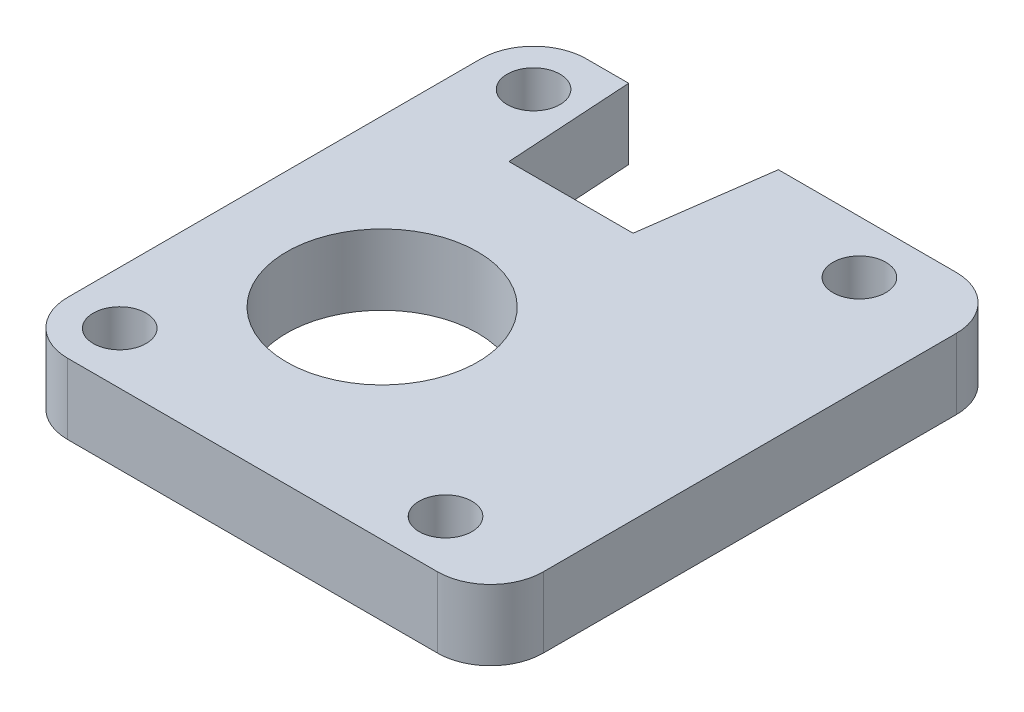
ISO-10303-21;
HEADER;
FILE_DESCRIPTION(('STEP AP214'),'2;1');
FILE_NAME('part.step','',(''),(''),'','','');
FILE_SCHEMA(('AUTOMOTIVE_DESIGN { 1 0 10303 214 1 1 1 1 }'));
ENDSEC;
DATA;
#1=APPLICATION_CONTEXT('core data for automotive mechanical design processes');
#2=APPLICATION_PROTOCOL_DEFINITION('international standard','automotive_design',2000,#1);
#3=PRODUCT_CONTEXT('',#1,'mechanical');
#4=PRODUCT('Part','Part','',(#3));
#5=PRODUCT_RELATED_PRODUCT_CATEGORY('part','',(#4));
#6=PRODUCT_DEFINITION_FORMATION('','',#4);
#7=PRODUCT_DEFINITION_CONTEXT('part definition',#1,'design');
#8=PRODUCT_DEFINITION('design','',#6,#7);
#9=PRODUCT_DEFINITION_SHAPE('','',#8);
#10=(LENGTH_UNIT() NAMED_UNIT(*) SI_UNIT(.MILLI.,.METRE.));
#11=(NAMED_UNIT(*) PLANE_ANGLE_UNIT() SI_UNIT($,.RADIAN.));
#12=(NAMED_UNIT(*) SI_UNIT($,.STERADIAN.) SOLID_ANGLE_UNIT());
#13=UNCERTAINTY_MEASURE_WITH_UNIT(LENGTH_MEASURE(1.E-05),#10,'distance_accuracy_value','');
#14=(GEOMETRIC_REPRESENTATION_CONTEXT(3) GLOBAL_UNCERTAINTY_ASSIGNED_CONTEXT((#13)) GLOBAL_UNIT_ASSIGNED_CONTEXT((#10,
#11,#12)) REPRESENTATION_CONTEXT('',''));
#15=CARTESIAN_POINT('',(0.,0.,0.));
#16=DIRECTION('',(0.,0.,1.));
#17=DIRECTION('',(1.,0.,0.));
#18=AXIS2_PLACEMENT_3D('',#15,#16,#17);
#19=CARTESIAN_POINT('',(0.,2.,0.));
#20=DIRECTION('',(0.,1.,0.));
#21=DIRECTION('',(0.,0.,1.));
#22=AXIS2_PLACEMENT_3D('',#19,#20,#21);
#23=PLANE('',#22);
#24=CARTESIAN_POINT('',(-4.1,2.,3.275));
#25=DIRECTION('',(0.,1.,0.));
#26=DIRECTION('',(0.,0.,1.));
#27=AXIS2_PLACEMENT_3D('',#24,#25,#26);
#28=CIRCLE('',#27,5.425);
#29=CARTESIAN_POINT('',(-4.1,2.,8.7));
#30=VERTEX_POINT('',#29);
#31=EDGE_CURVE('E187',#30,#30,#28,.F.);
#32=ORIENTED_EDGE('',*,*,#31,.T.);
#33=EDGE_LOOP('',(#32));
#34=FACE_BOUND('',#33,.T.);
#35=CARTESIAN_POINT('',(-10.5,2.,-11.725));
#36=DIRECTION('',(0.,1.,0.));
#37=DIRECTION('',(0.,0.,1.));
#38=AXIS2_PLACEMENT_3D('',#35,#36,#37);
#39=CIRCLE('',#38,1.5);
#40=CARTESIAN_POINT('',(-10.5,2.,-10.225));
#41=VERTEX_POINT('',#40);
#42=EDGE_CURVE('E190',#41,#41,#39,.F.);
#43=ORIENTED_EDGE('',*,*,#42,.T.);
#44=EDGE_LOOP('',(#43));
#45=FACE_BOUND('',#44,.T.);
#46=CARTESIAN_POINT('',(-10.5,2.,11.775));
#47=DIRECTION('',(0.,1.,0.));
#48=DIRECTION('',(0.,0.,1.));
#49=AXIS2_PLACEMENT_3D('',#46,#47,#48);
#50=CIRCLE('',#49,1.5);
#51=CARTESIAN_POINT('',(-10.5,2.,13.275));
#52=VERTEX_POINT('',#51);
#53=EDGE_CURVE('E193',#52,#52,#50,.F.);
#54=ORIENTED_EDGE('',*,*,#53,.T.);
#55=EDGE_LOOP('',(#54));
#56=FACE_BOUND('',#55,.T.);
#57=CARTESIAN_POINT('',(8.,2.,11.775));
#58=DIRECTION('',(0.,1.,0.));
#59=DIRECTION('',(0.,0.,1.));
#60=AXIS2_PLACEMENT_3D('',#57,#58,#59);
#61=CIRCLE('',#60,1.5);
#62=CARTESIAN_POINT('',(8.,2.,13.275));
#63=VERTEX_POINT('',#62);
#64=EDGE_CURVE('E196',#63,#63,#61,.F.);
#65=ORIENTED_EDGE('',*,*,#64,.T.);
#66=EDGE_LOOP('',(#65));
#67=FACE_BOUND('',#66,.T.);
#68=CARTESIAN_POINT('',(8.,2.,-11.725));
#69=DIRECTION('',(0.,1.,0.));
#70=DIRECTION('',(0.,0.,1.));
#71=AXIS2_PLACEMENT_3D('',#68,#69,#70);
#72=CIRCLE('',#71,1.5);
#73=CARTESIAN_POINT('',(8.,2.,-10.225));
#74=VERTEX_POINT('',#73);
#75=EDGE_CURVE('E199',#74,#74,#72,.F.);
#76=ORIENTED_EDGE('',*,*,#75,.T.);
#77=EDGE_LOOP('',(#76));
#78=FACE_BOUND('',#77,.T.);
#79=DIRECTION('',(-1.,0.,0.));
#80=VECTOR('',#79,1.);
#81=CARTESIAN_POINT('',(-8.1,2.,-14.725));
#82=LINE('',#81,#80);
#83=CARTESIAN_POINT('',(-10.5,2.,-14.725));
#84=VERTEX_POINT('',#83);
#85=CARTESIAN_POINT('',(-8.1,2.,-14.725));
#86=VERTEX_POINT('',#85);
#87=EDGE_CURVE('E117',#84,#86,#82,.F.);
#88=ORIENTED_EDGE('',*,*,#87,.F.);
#89=CARTESIAN_POINT('',(-10.5,2.,-11.725));
#90=DIRECTION('',(0.,1.,0.));
#91=DIRECTION('',(0.,0.,1.));
#92=AXIS2_PLACEMENT_3D('',#89,#90,#91);
#93=CIRCLE('',#92,3.);
#94=CARTESIAN_POINT('',(-13.5,2.,-11.725));
#95=VERTEX_POINT('',#94);
#96=EDGE_CURVE('E20',#95,#84,#93,.F.);
#97=ORIENTED_EDGE('',*,*,#96,.F.);
#98=DIRECTION('',(0.,0.,1.));
#99=VECTOR('',#98,1.);
#100=CARTESIAN_POINT('',(-13.5,2.,-11.725));
#101=LINE('',#100,#99);
#102=CARTESIAN_POINT('',(-13.5,2.,11.725));
#103=VERTEX_POINT('',#102);
#104=EDGE_CURVE('E103',#103,#95,#101,.F.);
#105=ORIENTED_EDGE('',*,*,#104,.F.);
#106=CARTESIAN_POINT('',(-10.5,2.,11.725));
#107=DIRECTION('',(0.,1.,0.));
#108=DIRECTION('',(0.,0.,1.));
#109=AXIS2_PLACEMENT_3D('',#106,#107,#108);
#110=CIRCLE('',#109,3.);
#111=CARTESIAN_POINT('',(-10.5,2.,14.725));
#112=VERTEX_POINT('',#111);
#113=EDGE_CURVE('E124',#112,#103,#110,.F.);
#114=ORIENTED_EDGE('',*,*,#113,.F.);
#115=DIRECTION('',(1.,0.,0.));
#116=VECTOR('',#115,1.);
#117=CARTESIAN_POINT('',(-10.5,2.,14.725));
#118=LINE('',#117,#116);
#119=CARTESIAN_POINT('',(10.5,2.,14.725));
#120=VERTEX_POINT('',#119);
#121=EDGE_CURVE('E158',#120,#112,#118,.F.);
#122=ORIENTED_EDGE('',*,*,#121,.F.);
#123=CARTESIAN_POINT('',(10.5,2.,11.725));
#124=DIRECTION('',(0.,1.,0.));
#125=DIRECTION('',(0.,0.,1.));
#126=AXIS2_PLACEMENT_3D('',#123,#124,#125);
#127=CIRCLE('',#126,3.);
#128=CARTESIAN_POINT('',(13.5,2.,11.725));
#129=VERTEX_POINT('',#128);
#130=EDGE_CURVE('E204',#129,#120,#127,.F.);
#131=ORIENTED_EDGE('',*,*,#130,.F.);
#132=DIRECTION('',(0.,0.,-1.));
#133=VECTOR('',#132,1.);
#134=CARTESIAN_POINT('',(13.5,2.,11.725));
#135=LINE('',#134,#133);
#136=CARTESIAN_POINT('',(13.5,2.,-11.725));
#137=VERTEX_POINT('',#136);
#138=EDGE_CURVE('E154',#137,#129,#135,.F.);
#139=ORIENTED_EDGE('',*,*,#138,.F.);
#140=CARTESIAN_POINT('',(10.5,2.,-11.725));
#141=DIRECTION('',(0.,1.,0.));
#142=DIRECTION('',(0.,0.,1.));
#143=AXIS2_PLACEMENT_3D('',#140,#141,#142);
#144=CIRCLE('',#143,3.);
#145=CARTESIAN_POINT('',(10.5,2.,-14.725));
#146=VERTEX_POINT('',#145);
#147=EDGE_CURVE('E202',#146,#137,#144,.F.);
#148=ORIENTED_EDGE('',*,*,#147,.F.);
#149=DIRECTION('',(-1.,0.,0.));
#150=VECTOR('',#149,1.);
#151=CARTESIAN_POINT('',(10.5,2.,-14.725));
#152=LINE('',#151,#150);
#153=CARTESIAN_POINT('',(0.4,2.,-14.725));
#154=VERTEX_POINT('',#153);
#155=EDGE_CURVE('E149',#154,#146,#152,.F.);
#156=ORIENTED_EDGE('',*,*,#155,.F.);
#157=DIRECTION('',(-0.136637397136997,0.,0.99062112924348));
#158=VECTOR('',#157,1.);
#159=CARTESIAN_POINT('',(0.4,2.,-14.725));
#160=LINE('',#159,#158);
#161=CARTESIAN_POINT('',(-0.599999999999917,2.,-7.47499999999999));
#162=VERTEX_POINT('',#161);
#163=EDGE_CURVE('E144',#162,#154,#160,.F.);
#164=ORIENTED_EDGE('',*,*,#163,.F.);
#165=DIRECTION('',(-1.,0.,0.));
#166=VECTOR('',#165,1.);
#167=CARTESIAN_POINT('',(-0.6,2.,-7.475));
#168=LINE('',#167,#166);
#169=CARTESIAN_POINT('',(-7.65,2.,-7.475));
#170=VERTEX_POINT('',#169);
#171=EDGE_CURVE('E139',#170,#162,#168,.F.);
#172=ORIENTED_EDGE('',*,*,#171,.F.);
#173=DIRECTION('',(-0.0619497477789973,0.,-0.998079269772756));
#174=VECTOR('',#173,1.);
#175=CARTESIAN_POINT('',(-7.65,2.,-7.475));
#176=LINE('',#175,#174);
#177=EDGE_CURVE('E129',#86,#170,#176,.F.);
#178=ORIENTED_EDGE('',*,*,#177,.F.);
#179=EDGE_LOOP('',(#88,#97,#105,#114,#122,#131,#139,#148,#156,#164,#172,#178));
#180=FACE_BOUND('',#179,.T.);
#181=ADVANCED_FACE('F17',(#34,#45,#56,#67,#78,#180),#23,.T.);
#182=CARTESIAN_POINT('',(-10.5,-2.,-11.725));
#183=DIRECTION('',(0.,1.,0.));
#184=DIRECTION('',(0.,0.,1.));
#185=AXIS2_PLACEMENT_3D('',#182,#183,#184);
#186=CYLINDRICAL_SURFACE('',#185,3.);
#187=DIRECTION('',(0.,1.,0.));
#188=VECTOR('',#187,1.);
#189=CARTESIAN_POINT('',(-10.5,-2.,-14.725));
#190=LINE('',#189,#188);
#191=CARTESIAN_POINT('',(-10.5,-2.,-14.725));
#192=VERTEX_POINT('',#191);
#193=EDGE_CURVE('E136',#192,#84,#190,.T.);
#194=ORIENTED_EDGE('',*,*,#193,.F.);
#195=CARTESIAN_POINT('',(-10.5,-2.,-11.725));
#196=DIRECTION('',(0.,1.,0.));
#197=DIRECTION('',(0.,0.,1.));
#198=AXIS2_PLACEMENT_3D('',#195,#196,#197);
#199=CIRCLE('',#198,3.);
#200=CARTESIAN_POINT('',(-13.5,-2.,-11.725));
#201=VERTEX_POINT('',#200);
#202=EDGE_CURVE('E123',#192,#201,#199,.T.);
#203=ORIENTED_EDGE('',*,*,#202,.T.);
#204=DIRECTION('',(0.,1.,0.));
#205=VECTOR('',#204,1.);
#206=CARTESIAN_POINT('',(-13.5,-2.,-11.725));
#207=LINE('',#206,#205);
#208=EDGE_CURVE('E108',#95,#201,#207,.F.);
#209=ORIENTED_EDGE('',*,*,#208,.F.);
#210=ORIENTED_EDGE('',*,*,#96,.T.);
#211=EDGE_LOOP('',(#194,#203,#209,#210));
#212=FACE_BOUND('',#211,.T.);
#213=ADVANCED_FACE('F122',(#212),#186,.T.);
#214=CARTESIAN_POINT('',(-13.5,-2.,-11.725));
#215=DIRECTION('',(-1.,0.,0.));
#216=DIRECTION('',(0.,0.,1.));
#217=AXIS2_PLACEMENT_3D('',#214,#215,#216);
#218=PLANE('',#217);
#219=ORIENTED_EDGE('',*,*,#208,.T.);
#220=DIRECTION('',(0.,0.,1.));
#221=VECTOR('',#220,1.);
#222=CARTESIAN_POINT('',(-13.5,-2.,0.));
#223=LINE('',#222,#221);
#224=CARTESIAN_POINT('',(-13.5,-2.,11.725));
#225=VERTEX_POINT('',#224);
#226=EDGE_CURVE('E185',#201,#225,#223,.T.);
#227=ORIENTED_EDGE('',*,*,#226,.T.);
#228=DIRECTION('',(0.,1.,0.));
#229=VECTOR('',#228,1.);
#230=CARTESIAN_POINT('',(-13.5,-2.,11.725));
#231=LINE('',#230,#229);
#232=EDGE_CURVE('E110',#103,#225,#231,.F.);
#233=ORIENTED_EDGE('',*,*,#232,.F.);
#234=ORIENTED_EDGE('',*,*,#104,.T.);
#235=EDGE_LOOP('',(#219,#227,#233,#234));
#236=FACE_BOUND('',#235,.T.);
#237=ADVANCED_FACE('F105',(#236),#218,.T.);
#238=CARTESIAN_POINT('',(-10.5,-2.,11.725));
#239=DIRECTION('',(0.,1.,0.));
#240=DIRECTION('',(0.,0.,1.));
#241=AXIS2_PLACEMENT_3D('',#238,#239,#240);
#242=CYLINDRICAL_SURFACE('',#241,3.);
#243=ORIENTED_EDGE('',*,*,#232,.T.);
#244=CARTESIAN_POINT('',(-10.5,-2.,11.725));
#245=DIRECTION('',(0.,1.,0.));
#246=DIRECTION('',(0.,0.,1.));
#247=AXIS2_PLACEMENT_3D('',#244,#245,#246);
#248=CIRCLE('',#247,3.);
#249=CARTESIAN_POINT('',(-10.5,-2.,14.725));
#250=VERTEX_POINT('',#249);
#251=EDGE_CURVE('E182',#225,#250,#248,.T.);
#252=ORIENTED_EDGE('',*,*,#251,.T.);
#253=DIRECTION('',(0.,1.,0.));
#254=VECTOR('',#253,1.);
#255=CARTESIAN_POINT('',(-10.5,-2.,14.725));
#256=LINE('',#255,#254);
#257=EDGE_CURVE('E159',#112,#250,#256,.F.);
#258=ORIENTED_EDGE('',*,*,#257,.F.);
#259=ORIENTED_EDGE('',*,*,#113,.T.);
#260=EDGE_LOOP('',(#243,#252,#258,#259));
#261=FACE_BOUND('',#260,.T.);
#262=ADVANCED_FACE('F293',(#261),#242,.T.);
#263=CARTESIAN_POINT('',(-10.5,-2.,14.725));
#264=DIRECTION('',(0.,0.,1.));
#265=DIRECTION('',(1.,0.,0.));
#266=AXIS2_PLACEMENT_3D('',#263,#264,#265);
#267=PLANE('',#266);
#268=ORIENTED_EDGE('',*,*,#257,.T.);
#269=DIRECTION('',(1.,0.,0.));
#270=VECTOR('',#269,1.);
#271=CARTESIAN_POINT('',(0.,-2.,14.725));
#272=LINE('',#271,#270);
#273=CARTESIAN_POINT('',(10.5,-2.,14.725));
#274=VERTEX_POINT('',#273);
#275=EDGE_CURVE('E181',#250,#274,#272,.T.);
#276=ORIENTED_EDGE('',*,*,#275,.T.);
#277=DIRECTION('',(0.,1.,0.));
#278=VECTOR('',#277,1.);
#279=CARTESIAN_POINT('',(10.5,-2.,14.725));
#280=LINE('',#279,#278);
#281=EDGE_CURVE('E157',#120,#274,#280,.F.);
#282=ORIENTED_EDGE('',*,*,#281,.F.);
#283=ORIENTED_EDGE('',*,*,#121,.T.);
#284=EDGE_LOOP('',(#268,#276,#282,#283));
#285=FACE_BOUND('',#284,.T.);
#286=ADVANCED_FACE('F290',(#285),#267,.T.);
#287=CARTESIAN_POINT('',(10.5,-2.,11.725));
#288=DIRECTION('',(0.,1.,0.));
#289=DIRECTION('',(0.,0.,1.));
#290=AXIS2_PLACEMENT_3D('',#287,#288,#289);
#291=CYLINDRICAL_SURFACE('',#290,3.);
#292=ORIENTED_EDGE('',*,*,#281,.T.);
#293=CARTESIAN_POINT('',(10.5,-2.,11.725));
#294=DIRECTION('',(0.,1.,0.));
#295=DIRECTION('',(0.,0.,1.));
#296=AXIS2_PLACEMENT_3D('',#293,#294,#295);
#297=CIRCLE('',#296,3.);
#298=CARTESIAN_POINT('',(13.5,-2.,11.725));
#299=VERTEX_POINT('',#298);
#300=EDGE_CURVE('E178',#274,#299,#297,.T.);
#301=ORIENTED_EDGE('',*,*,#300,.T.);
#302=DIRECTION('',(0.,1.,0.));
#303=VECTOR('',#302,1.);
#304=CARTESIAN_POINT('',(13.5,-2.,11.725));
#305=LINE('',#304,#303);
#306=EDGE_CURVE('E156',#129,#299,#305,.F.);
#307=ORIENTED_EDGE('',*,*,#306,.F.);
#308=ORIENTED_EDGE('',*,*,#130,.T.);
#309=EDGE_LOOP('',(#292,#301,#307,#308));
#310=FACE_BOUND('',#309,.T.);
#311=ADVANCED_FACE('F288',(#310),#291,.T.);
#312=CARTESIAN_POINT('',(13.5,-2.,11.725));
#313=DIRECTION('',(1.,0.,0.));
#314=DIRECTION('',(0.,0.,-1.));
#315=AXIS2_PLACEMENT_3D('',#312,#313,#314);
#316=PLANE('',#315);
#317=ORIENTED_EDGE('',*,*,#306,.T.);
#318=DIRECTION('',(0.,0.,1.));
#319=VECTOR('',#318,1.);
#320=CARTESIAN_POINT('',(13.5,-2.,0.));
#321=LINE('',#320,#319);
#322=CARTESIAN_POINT('',(13.5,-2.,-11.725));
#323=VERTEX_POINT('',#322);
#324=EDGE_CURVE('E177',#299,#323,#321,.F.);
#325=ORIENTED_EDGE('',*,*,#324,.T.);
#326=DIRECTION('',(0.,1.,0.));
#327=VECTOR('',#326,1.);
#328=CARTESIAN_POINT('',(13.5,-2.,-11.725));
#329=LINE('',#328,#327);
#330=EDGE_CURVE('E151',#137,#323,#329,.F.);
#331=ORIENTED_EDGE('',*,*,#330,.F.);
#332=ORIENTED_EDGE('',*,*,#138,.T.);
#333=EDGE_LOOP('',(#317,#325,#331,#332));
#334=FACE_BOUND('',#333,.T.);
#335=ADVANCED_FACE('F286',(#334),#316,.T.);
#336=CARTESIAN_POINT('',(10.5,-2.,-11.725));
#337=DIRECTION('',(0.,1.,0.));
#338=DIRECTION('',(0.,0.,1.));
#339=AXIS2_PLACEMENT_3D('',#336,#337,#338);
#340=CYLINDRICAL_SURFACE('',#339,3.);
#341=ORIENTED_EDGE('',*,*,#330,.T.);
#342=CARTESIAN_POINT('',(10.5,-2.,-11.725));
#343=DIRECTION('',(0.,1.,0.));
#344=DIRECTION('',(0.,0.,1.));
#345=AXIS2_PLACEMENT_3D('',#342,#343,#344);
#346=CIRCLE('',#345,3.);
#347=CARTESIAN_POINT('',(10.5,-2.,-14.725));
#348=VERTEX_POINT('',#347);
#349=EDGE_CURVE('E173',#323,#348,#346,.T.);
#350=ORIENTED_EDGE('',*,*,#349,.T.);
#351=DIRECTION('',(0.,1.,0.));
#352=VECTOR('',#351,1.);
#353=CARTESIAN_POINT('',(10.5,-2.,-14.725));
#354=LINE('',#353,#352);
#355=EDGE_CURVE('E146',#146,#348,#354,.F.);
#356=ORIENTED_EDGE('',*,*,#355,.F.);
#357=ORIENTED_EDGE('',*,*,#147,.T.);
#358=EDGE_LOOP('',(#341,#350,#356,#357));
#359=FACE_BOUND('',#358,.T.);
#360=ADVANCED_FACE('F282',(#359),#340,.T.);
#361=CARTESIAN_POINT('',(10.5,-2.,-14.725));
#362=DIRECTION('',(0.,0.,-1.));
#363=DIRECTION('',(-1.,0.,0.));
#364=AXIS2_PLACEMENT_3D('',#361,#362,#363);
#365=PLANE('',#364);
#366=ORIENTED_EDGE('',*,*,#355,.T.);
#367=DIRECTION('',(1.,0.,0.));
#368=VECTOR('',#367,1.);
#369=CARTESIAN_POINT('',(0.,-2.,-14.725));
#370=LINE('',#369,#368);
#371=CARTESIAN_POINT('',(0.4,-2.,-14.725));
#372=VERTEX_POINT('',#371);
#373=EDGE_CURVE('E176',#348,#372,#370,.F.);
#374=ORIENTED_EDGE('',*,*,#373,.T.);
#375=DIRECTION('',(0.,1.,0.));
#376=VECTOR('',#375,1.);
#377=CARTESIAN_POINT('',(0.4,-2.,-14.725));
#378=LINE('',#377,#376);
#379=EDGE_CURVE('E141',#154,#372,#378,.F.);
#380=ORIENTED_EDGE('',*,*,#379,.F.);
#381=ORIENTED_EDGE('',*,*,#155,.T.);
#382=EDGE_LOOP('',(#366,#374,#380,#381));
#383=FACE_BOUND('',#382,.T.);
#384=ADVANCED_FACE('F276',(#383),#365,.T.);
#385=CARTESIAN_POINT('',(0.4,-2.,-14.725));
#386=DIRECTION('',(-0.99062112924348,0.,-0.136637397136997));
#387=DIRECTION('',(-0.136637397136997,0.,0.99062112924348));
#388=AXIS2_PLACEMENT_3D('',#385,#386,#387);
#389=PLANE('',#388);
#390=ORIENTED_EDGE('',*,*,#379,.T.);
#391=DIRECTION('',(-0.136637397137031,0.,0.990621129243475));
#392=VECTOR('',#391,1.);
#393=CARTESIAN_POINT('',(0.4,-2.,-14.725));
#394=LINE('',#393,#392);
#395=CARTESIAN_POINT('',(-0.6,-2.,-7.475));
#396=VERTEX_POINT('',#395);
#397=EDGE_CURVE('E223',#372,#396,#394,.T.);
#398=ORIENTED_EDGE('',*,*,#397,.T.);
#399=DIRECTION('',(0.,1.,0.));
#400=VECTOR('',#399,1.);
#401=CARTESIAN_POINT('',(-0.6,-2.,-7.475));
#402=LINE('',#401,#400);
#403=EDGE_CURVE('E132',#162,#396,#402,.F.);
#404=ORIENTED_EDGE('',*,*,#403,.F.);
#405=ORIENTED_EDGE('',*,*,#163,.T.);
#406=EDGE_LOOP('',(#390,#398,#404,#405));
#407=FACE_BOUND('',#406,.T.);
#408=ADVANCED_FACE('F272',(#407),#389,.T.);
#409=CARTESIAN_POINT('',(-0.6,-2.,-7.475));
#410=DIRECTION('',(0.,0.,-1.));
#411=DIRECTION('',(-1.,0.,0.));
#412=AXIS2_PLACEMENT_3D('',#409,#410,#411);
#413=PLANE('',#412);
#414=ORIENTED_EDGE('',*,*,#403,.T.);
#415=DIRECTION('',(1.,0.,0.));
#416=VECTOR('',#415,1.);
#417=CARTESIAN_POINT('',(0.,-2.,-7.475));
#418=LINE('',#417,#416);
#419=CARTESIAN_POINT('',(-7.65,-2.,-7.475));
#420=VERTEX_POINT('',#419);
#421=EDGE_CURVE('E226',#396,#420,#418,.F.);
#422=ORIENTED_EDGE('',*,*,#421,.T.);
#423=DIRECTION('',(0.,1.,0.));
#424=VECTOR('',#423,1.);
#425=CARTESIAN_POINT('',(-7.65,-2.,-7.475));
#426=LINE('',#425,#424);
#427=EDGE_CURVE('E131',#170,#420,#426,.F.);
#428=ORIENTED_EDGE('',*,*,#427,.F.);
#429=ORIENTED_EDGE('',*,*,#171,.T.);
#430=EDGE_LOOP('',(#414,#422,#428,#429));
#431=FACE_BOUND('',#430,.T.);
#432=ADVANCED_FACE('F266',(#431),#413,.T.);
#433=CARTESIAN_POINT('',(-7.65,-2.,-7.475));
#434=DIRECTION('',(0.998079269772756,0.,-0.0619497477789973));
#435=DIRECTION('',(-0.0619497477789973,0.,-0.998079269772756));
#436=AXIS2_PLACEMENT_3D('',#433,#434,#435);
#437=PLANE('',#436);
#438=ORIENTED_EDGE('',*,*,#427,.T.);
#439=DIRECTION('',(-0.0619497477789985,0.,-0.998079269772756));
#440=VECTOR('',#439,1.);
#441=CARTESIAN_POINT('',(-7.65,-2.,-7.475));
#442=LINE('',#441,#440);
#443=CARTESIAN_POINT('',(-8.1,-2.,-14.725));
#444=VERTEX_POINT('',#443);
#445=EDGE_CURVE('E234',#420,#444,#442,.T.);
#446=ORIENTED_EDGE('',*,*,#445,.T.);
#447=DIRECTION('',(0.,1.,0.));
#448=VECTOR('',#447,1.);
#449=CARTESIAN_POINT('',(-8.1,-2.,-14.725));
#450=LINE('',#449,#448);
#451=EDGE_CURVE('E35',#86,#444,#450,.F.);
#452=ORIENTED_EDGE('',*,*,#451,.F.);
#453=ORIENTED_EDGE('',*,*,#177,.T.);
#454=EDGE_LOOP('',(#438,#446,#452,#453));
#455=FACE_BOUND('',#454,.T.);
#456=ADVANCED_FACE('F262',(#455),#437,.T.);
#457=CARTESIAN_POINT('',(-8.1,-2.,-14.725));
#458=DIRECTION('',(0.,0.,-1.));
#459=DIRECTION('',(-1.,0.,0.));
#460=AXIS2_PLACEMENT_3D('',#457,#458,#459);
#461=PLANE('',#460);
#462=ORIENTED_EDGE('',*,*,#451,.T.);
#463=DIRECTION('',(1.,0.,0.));
#464=VECTOR('',#463,1.);
#465=CARTESIAN_POINT('',(0.,-2.,-14.725));
#466=LINE('',#465,#464);
#467=EDGE_CURVE('E172',#444,#192,#466,.F.);
#468=ORIENTED_EDGE('',*,*,#467,.T.);
#469=ORIENTED_EDGE('',*,*,#193,.T.);
#470=ORIENTED_EDGE('',*,*,#87,.T.);
#471=EDGE_LOOP('',(#462,#468,#469,#470));
#472=FACE_BOUND('',#471,.T.);
#473=ADVANCED_FACE('F256',(#472),#461,.T.);
#474=CARTESIAN_POINT('',(8.,-2.,-11.725));
#475=DIRECTION('',(0.,1.,0.));
#476=DIRECTION('',(0.,0.,1.));
#477=AXIS2_PLACEMENT_3D('',#474,#475,#476);
#478=CYLINDRICAL_SURFACE('',#477,1.5);
#479=ORIENTED_EDGE('',*,*,#75,.F.);
#480=EDGE_LOOP('',(#479));
#481=FACE_BOUND('',#480,.T.);
#482=CARTESIAN_POINT('',(8.,-2.,-11.725));
#483=DIRECTION('',(0.,1.,0.));
#484=DIRECTION('',(0.,0.,1.));
#485=AXIS2_PLACEMENT_3D('',#482,#483,#484);
#486=CIRCLE('',#485,1.5);
#487=CARTESIAN_POINT('',(8.,-2.,-10.225));
#488=VERTEX_POINT('',#487);
#489=EDGE_CURVE('E169',#488,#488,#486,.F.);
#490=ORIENTED_EDGE('',*,*,#489,.T.);
#491=EDGE_LOOP('',(#490));
#492=FACE_BOUND('',#491,.T.);
#493=ADVANCED_FACE('F326',(#481,#492),#478,.F.);
#494=CARTESIAN_POINT('',(8.,-2.,11.775));
#495=DIRECTION('',(0.,1.,0.));
#496=DIRECTION('',(0.,0.,1.));
#497=AXIS2_PLACEMENT_3D('',#494,#495,#496);
#498=CYLINDRICAL_SURFACE('',#497,1.5);
#499=ORIENTED_EDGE('',*,*,#64,.F.);
#500=EDGE_LOOP('',(#499));
#501=FACE_BOUND('',#500,.T.);
#502=CARTESIAN_POINT('',(8.,-2.,11.775));
#503=DIRECTION('',(0.,1.,0.));
#504=DIRECTION('',(0.,0.,1.));
#505=AXIS2_PLACEMENT_3D('',#502,#503,#504);
#506=CIRCLE('',#505,1.5);
#507=CARTESIAN_POINT('',(8.,-2.,13.275));
#508=VERTEX_POINT('',#507);
#509=EDGE_CURVE('E166',#508,#508,#506,.F.);
#510=ORIENTED_EDGE('',*,*,#509,.T.);
#511=EDGE_LOOP('',(#510));
#512=FACE_BOUND('',#511,.T.);
#513=ADVANCED_FACE('F322',(#501,#512),#498,.F.);
#514=CARTESIAN_POINT('',(-10.5,-2.,11.775));
#515=DIRECTION('',(0.,1.,0.));
#516=DIRECTION('',(0.,0.,1.));
#517=AXIS2_PLACEMENT_3D('',#514,#515,#516);
#518=CYLINDRICAL_SURFACE('',#517,1.5);
#519=ORIENTED_EDGE('',*,*,#53,.F.);
#520=EDGE_LOOP('',(#519));
#521=FACE_BOUND('',#520,.T.);
#522=CARTESIAN_POINT('',(-10.5,-2.,11.775));
#523=DIRECTION('',(0.,1.,0.));
#524=DIRECTION('',(0.,0.,1.));
#525=AXIS2_PLACEMENT_3D('',#522,#523,#524);
#526=CIRCLE('',#525,1.5);
#527=CARTESIAN_POINT('',(-10.5,-2.,13.275));
#528=VERTEX_POINT('',#527);
#529=EDGE_CURVE('E163',#528,#528,#526,.F.);
#530=ORIENTED_EDGE('',*,*,#529,.T.);
#531=EDGE_LOOP('',(#530));
#532=FACE_BOUND('',#531,.T.);
#533=ADVANCED_FACE('F318',(#521,#532),#518,.F.);
#534=CARTESIAN_POINT('',(-10.5,-2.,-11.725));
#535=DIRECTION('',(0.,1.,0.));
#536=DIRECTION('',(0.,0.,1.));
#537=AXIS2_PLACEMENT_3D('',#534,#535,#536);
#538=CYLINDRICAL_SURFACE('',#537,1.5);
#539=ORIENTED_EDGE('',*,*,#42,.F.);
#540=EDGE_LOOP('',(#539));
#541=FACE_BOUND('',#540,.T.);
#542=CARTESIAN_POINT('',(-10.5,-2.,-11.725));
#543=DIRECTION('',(0.,1.,0.));
#544=DIRECTION('',(0.,0.,1.));
#545=AXIS2_PLACEMENT_3D('',#542,#543,#544);
#546=CIRCLE('',#545,1.5);
#547=CARTESIAN_POINT('',(-10.5,-2.,-10.225));
#548=VERTEX_POINT('',#547);
#549=EDGE_CURVE('E26',#548,#548,#546,.F.);
#550=ORIENTED_EDGE('',*,*,#549,.T.);
#551=EDGE_LOOP('',(#550));
#552=FACE_BOUND('',#551,.T.);
#553=ADVANCED_FACE('F310',(#541,#552),#538,.F.);
#554=CARTESIAN_POINT('',(-4.1,-2.,3.275));
#555=DIRECTION('',(0.,1.,0.));
#556=DIRECTION('',(0.,0.,1.));
#557=AXIS2_PLACEMENT_3D('',#554,#555,#556);
#558=CYLINDRICAL_SURFACE('',#557,5.425);
#559=ORIENTED_EDGE('',*,*,#31,.F.);
#560=EDGE_LOOP('',(#559));
#561=FACE_BOUND('',#560,.T.);
#562=CARTESIAN_POINT('',(-4.1,-2.,3.275));
#563=DIRECTION('',(0.,1.,0.));
#564=DIRECTION('',(0.,0.,1.));
#565=AXIS2_PLACEMENT_3D('',#562,#563,#564);
#566=CIRCLE('',#565,5.425);
#567=CARTESIAN_POINT('',(-4.1,-2.,8.7));
#568=VERTEX_POINT('',#567);
#569=EDGE_CURVE('E11',#568,#568,#566,.F.);
#570=ORIENTED_EDGE('',*,*,#569,.T.);
#571=EDGE_LOOP('',(#570));
#572=FACE_BOUND('',#571,.T.);
#573=ADVANCED_FACE('F304',(#561,#572),#558,.F.);
#574=CARTESIAN_POINT('',(0.,-2.,0.));
#575=DIRECTION('',(0.,1.,0.));
#576=DIRECTION('',(0.,0.,1.));
#577=AXIS2_PLACEMENT_3D('',#574,#575,#576);
#578=PLANE('',#577);
#579=ORIENTED_EDGE('',*,*,#569,.F.);
#580=EDGE_LOOP('',(#579));
#581=FACE_BOUND('',#580,.T.);
#582=ORIENTED_EDGE('',*,*,#549,.F.);
#583=EDGE_LOOP('',(#582));
#584=FACE_BOUND('',#583,.T.);
#585=ORIENTED_EDGE('',*,*,#529,.F.);
#586=EDGE_LOOP('',(#585));
#587=FACE_BOUND('',#586,.T.);
#588=ORIENTED_EDGE('',*,*,#509,.F.);
#589=EDGE_LOOP('',(#588));
#590=FACE_BOUND('',#589,.T.);
#591=ORIENTED_EDGE('',*,*,#489,.F.);
#592=EDGE_LOOP('',(#591));
#593=FACE_BOUND('',#592,.T.);
#594=ORIENTED_EDGE('',*,*,#445,.F.);
#595=ORIENTED_EDGE('',*,*,#421,.F.);
#596=ORIENTED_EDGE('',*,*,#397,.F.);
#597=ORIENTED_EDGE('',*,*,#373,.F.);
#598=ORIENTED_EDGE('',*,*,#349,.F.);
#599=ORIENTED_EDGE('',*,*,#324,.F.);
#600=ORIENTED_EDGE('',*,*,#300,.F.);
#601=ORIENTED_EDGE('',*,*,#275,.F.);
#602=ORIENTED_EDGE('',*,*,#251,.F.);
#603=ORIENTED_EDGE('',*,*,#226,.F.);
#604=ORIENTED_EDGE('',*,*,#202,.F.);
#605=ORIENTED_EDGE('',*,*,#467,.F.);
#606=EDGE_LOOP('',(#594,#595,#596,#597,#598,#599,#600,#601,#602,#603,#604,#605));
#607=FACE_BOUND('',#606,.T.);
#608=ADVANCED_FACE('F259',(#581,#584,#587,#590,#593,#607),#578,.F.);
#609=CLOSED_SHELL('',(#181,#213,#237,#262,#286,#311,#335,#360,#384,#408,#432,#456,#473,#493,
#513,#533,#553,#573,#608));
#610=MANIFOLD_SOLID_BREP('B1',#609);
#611=ADVANCED_BREP_SHAPE_REPRESENTATION('',(#18,#610),#14);
#612=SHAPE_DEFINITION_REPRESENTATION(#9,#611);
ENDSEC;
END-ISO-10303-21;
